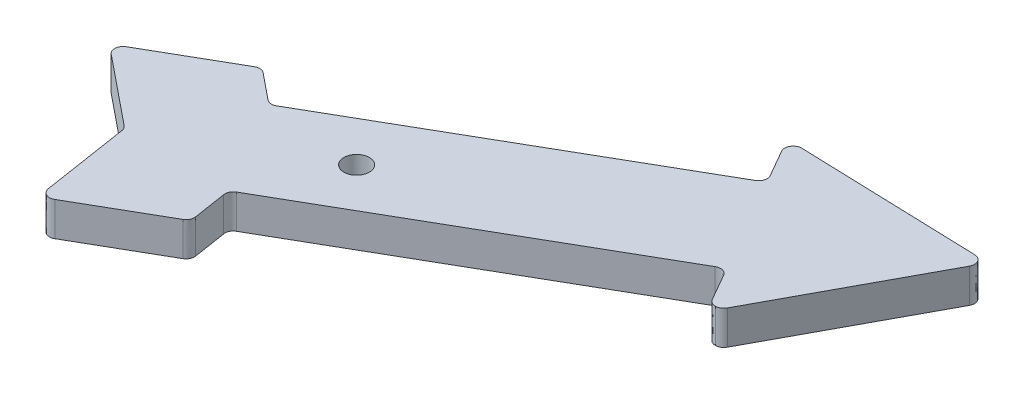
ISO-10303-21;
HEADER;
FILE_DESCRIPTION(('STEP AP214'),'2;1');
FILE_NAME('part.step','',(''),(''),'','','');
FILE_SCHEMA(('AUTOMOTIVE_DESIGN { 1 0 10303 214 1 1 1 1 }'));
ENDSEC;
DATA;
#1=APPLICATION_CONTEXT('core data for automotive mechanical design processes');
#2=APPLICATION_PROTOCOL_DEFINITION('international standard','automotive_design',2000,#1);
#3=PRODUCT_CONTEXT('',#1,'mechanical');
#4=PRODUCT('Part','Part','',(#3));
#5=PRODUCT_RELATED_PRODUCT_CATEGORY('part','',(#4));
#6=PRODUCT_DEFINITION_FORMATION('','',#4);
#7=PRODUCT_DEFINITION_CONTEXT('part definition',#1,'design');
#8=PRODUCT_DEFINITION('design','',#6,#7);
#9=PRODUCT_DEFINITION_SHAPE('','',#8);
#10=(LENGTH_UNIT() NAMED_UNIT(*) SI_UNIT(.MILLI.,.METRE.));
#11=(NAMED_UNIT(*) PLANE_ANGLE_UNIT() SI_UNIT($,.RADIAN.));
#12=(NAMED_UNIT(*) SI_UNIT($,.STERADIAN.) SOLID_ANGLE_UNIT());
#13=UNCERTAINTY_MEASURE_WITH_UNIT(LENGTH_MEASURE(1.E-05),#10,'distance_accuracy_value','');
#14=(GEOMETRIC_REPRESENTATION_CONTEXT(3) GLOBAL_UNCERTAINTY_ASSIGNED_CONTEXT((#13)) GLOBAL_UNIT_ASSIGNED_CONTEXT((#10,
#11,#12)) REPRESENTATION_CONTEXT('',''));
#15=CARTESIAN_POINT('',(0.,0.,0.));
#16=DIRECTION('',(0.,0.,1.));
#17=DIRECTION('',(1.,0.,0.));
#18=AXIS2_PLACEMENT_3D('',#15,#16,#17);
#19=CARTESIAN_POINT('',(-4.69190108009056,20.,10.2608139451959));
#20=DIRECTION('',(0.,1.,0.));
#21=DIRECTION('',(-0.86602540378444,0.,0.499999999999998));
#22=AXIS2_PLACEMENT_3D('',#19,#20,#21);
#23=PLANE('',#22);
#24=CARTESIAN_POINT('',(-4.7753296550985,20.,10.8484864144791));
#25=CARTESIAN_POINT('',(-4.84013398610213,20.,10.4316420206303));
#26=CARTESIAN_POINT('',(-4.65129163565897,20.,10.0383265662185));
#27=CARTESIAN_POINT('',(-4.2856021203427,20.,9.82811938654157));
#28=B_SPLINE_CURVE_WITH_KNOTS('',3,(#24,#25,#26,#27),.UNSPECIFIED.,.F.,.F.,(4,4),
(0.96551724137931,1.),.UNSPECIFIED.);
#29=CARTESIAN_POINT('',(-4.7753296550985,20.,10.8484864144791));
#30=VERTEX_POINT('',#29);
#31=CARTESIAN_POINT('',(-4.2856021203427,20.,9.82811938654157));
#32=VERTEX_POINT('',#31);
#33=EDGE_CURVE('E753',#30,#32,#28,.T.);
#34=ORIENTED_EDGE('',*,*,#33,.T.);
#35=DIRECTION('',(0.866935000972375,0.,-0.498421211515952));
#36=VECTOR('',#35,1.);
#37=CARTESIAN_POINT('',(-4.2856021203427,20.,9.82811938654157));
#38=LINE('',#37,#36);
#39=CARTESIAN_POINT('',(31.4467437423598,20.,-10.7152421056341));
#40=VERTEX_POINT('',#39);
#41=EDGE_CURVE('E163',#32,#40,#38,.T.);
#42=ORIENTED_EDGE('',*,*,#41,.T.);
#43=CARTESIAN_POINT('',(31.4467437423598,20.,-10.7152421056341));
#44=CARTESIAN_POINT('',(31.9241639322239,20.,-10.9897260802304));
#45=CARTESIAN_POINT('',(32.5376263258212,20.,-10.824178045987));
#46=CARTESIAN_POINT('',(32.8121103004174,20.,-10.3467578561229));
#47=B_SPLINE_CURVE_WITH_KNOTS('',3,(#43,#44,#45,#46),.UNSPECIFIED.,.F.,.F.,(4,4),
(0.0344827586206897,0.0689655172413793),.UNSPECIFIED.);
#48=CARTESIAN_POINT('',(32.8121103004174,20.,-10.3467578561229));
#49=VERTEX_POINT('',#48);
#50=EDGE_CURVE('E626',#40,#49,#47,.T.);
#51=ORIENTED_EDGE('',*,*,#50,.T.);
#52=DIRECTION('',(0.498400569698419,0.,0.866946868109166));
#53=VECTOR('',#52,1.);
#54=CARTESIAN_POINT('',(32.8121103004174,20.,-10.3467578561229));
#55=LINE('',#54,#53);
#56=CARTESIAN_POINT('',(34.6211579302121,20.,-7.19999544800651));
#57=VERTEX_POINT('',#56);
#58=EDGE_CURVE('E781',#49,#57,#55,.T.);
#59=ORIENTED_EDGE('',*,*,#58,.T.);
#60=CARTESIAN_POINT('',(34.6211579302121,20.,-7.19999544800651));
#61=CARTESIAN_POINT('',(34.8069383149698,20.,-6.87701438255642));
#62=CARTESIAN_POINT('',(35.1291082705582,20.,-6.69339965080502));
#63=CARTESIAN_POINT('',(35.5016397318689,20.,-6.69855623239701));
#64=B_SPLINE_CURVE_WITH_KNOTS('',3,(#60,#61,#62,#63),.UNSPECIFIED.,.F.,.F.,(4,4),
(0.103448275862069,0.137931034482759),.UNSPECIFIED.);
#65=CARTESIAN_POINT('',(35.5016397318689,20.,-6.69855623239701));
#66=VERTEX_POINT('',#65);
#67=EDGE_CURVE('E462',#57,#66,#64,.T.);
#68=ORIENTED_EDGE('',*,*,#67,.T.);
#69=CARTESIAN_POINT('',(35.5016397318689,20.,-6.69855623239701));
#70=CARTESIAN_POINT('',(35.8741345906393,20.,-6.70357621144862));
#71=CARTESIAN_POINT('',(36.1913068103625,20.,-6.89581781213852));
#72=CARTESIAN_POINT('',(36.3682234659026,20.,-7.22358917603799));
#73=B_SPLINE_CURVE_WITH_KNOTS('',3,(#69,#70,#71,#72),.UNSPECIFIED.,.F.,.F.,(4,4),
(0.137931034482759,0.172413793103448),.UNSPECIFIED.);
#74=CARTESIAN_POINT('',(36.3682234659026,20.,-7.22358917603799));
#75=VERTEX_POINT('',#74);
#76=EDGE_CURVE('E457',#66,#75,#73,.T.);
#77=ORIENTED_EDGE('',*,*,#76,.T.);
#78=DIRECTION('',(0.474814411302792,0.,-0.880085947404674));
#79=VECTOR('',#78,1.);
#80=CARTESIAN_POINT('',(36.3682234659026,20.,-7.22358917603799));
#81=LINE('',#80,#79);
#82=CARTESIAN_POINT('',(46.3412612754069,20.,-25.7089809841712));
#83=VERTEX_POINT('',#82);
#84=EDGE_CURVE('E461',#75,#83,#81,.T.);
#85=ORIENTED_EDGE('',*,*,#84,.T.);
#86=CARTESIAN_POINT('',(46.3412612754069,20.,-25.7089809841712));
#87=CARTESIAN_POINT('',(46.5105999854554,20.,-26.0226777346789));
#88=CARTESIAN_POINT('',(46.5056903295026,20.,-26.3731815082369));
#89=CARTESIAN_POINT('',(46.3280965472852,20.,-26.6821829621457));
#90=B_SPLINE_CURVE_WITH_KNOTS('',3,(#86,#87,#88,#89),.UNSPECIFIED.,.F.,.F.,(4,4),
(0.206896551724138,0.241379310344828),.UNSPECIFIED.);
#91=CARTESIAN_POINT('',(46.3280965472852,20.,-26.6821829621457));
#92=VERTEX_POINT('',#91);
#93=EDGE_CURVE('E427',#83,#92,#90,.T.);
#94=ORIENTED_EDGE('',*,*,#93,.T.);
#95=CARTESIAN_POINT('',(46.3280965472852,20.,-26.6821829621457));
#96=CARTESIAN_POINT('',(46.1505893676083,20.,-26.9912344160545));
#97=CARTESIAN_POINT('',(45.8498918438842,20.,-27.1716578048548));
#98=CARTESIAN_POINT('',(45.4936959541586,20.,-27.1832071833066));
#99=B_SPLINE_CURVE_WITH_KNOTS('',3,(#95,#96,#97,#98),.UNSPECIFIED.,.F.,.F.,(4,4),
(0.241379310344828,0.275862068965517),.UNSPECIFIED.);
#100=CARTESIAN_POINT('',(45.4936959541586,20.,-27.1832071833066));
#101=VERTEX_POINT('',#100);
#102=EDGE_CURVE('E422',#92,#101,#99,.T.);
#103=ORIENTED_EDGE('',*,*,#102,.T.);
#104=DIRECTION('',(-0.999472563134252,0.,-0.0324745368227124));
#105=VECTOR('',#104,1.);
#106=CARTESIAN_POINT('',(45.4936959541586,20.,-27.1832071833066));
#107=LINE('',#106,#105);
#108=CARTESIAN_POINT('',(24.5007223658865,20.,-27.8653040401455));
#109=VERTEX_POINT('',#108);
#110=EDGE_CURVE('E417',#101,#109,#107,.T.);
#111=ORIENTED_EDGE('',*,*,#110,.T.);
#112=CARTESIAN_POINT('',(24.5007223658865,20.,-27.8653040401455));
#113=CARTESIAN_POINT('',(24.1283619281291,20.,-27.8774512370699));
#114=CARTESIAN_POINT('',(23.8027263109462,20.,-27.7000686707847));
#115=CARTESIAN_POINT('',(23.6110618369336,20.,-27.3806412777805));
#116=B_SPLINE_CURVE_WITH_KNOTS('',3,(#112,#113,#114,#115),.UNSPECIFIED.,.F.,.F.,(4,4),
(0.310344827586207,0.344827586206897),.UNSPECIFIED.);
#117=CARTESIAN_POINT('',(23.6110618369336,20.,-27.3806412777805));
#118=VERTEX_POINT('',#117);
#119=EDGE_CURVE('E409',#109,#118,#116,.T.);
#120=ORIENTED_EDGE('',*,*,#119,.T.);
#121=CARTESIAN_POINT('',(23.6110618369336,20.,-27.3806412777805));
#122=CARTESIAN_POINT('',(23.4191241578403,20.,-27.061287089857));
#123=CARTESIAN_POINT('',(23.4156149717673,20.,-26.6905651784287));
#124=CARTESIAN_POINT('',(23.6013587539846,20.,-26.3674475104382));
#125=B_SPLINE_CURVE_WITH_KNOTS('',3,(#121,#122,#123,#124),.UNSPECIFIED.,.F.,.F.,(4,4),
(0.344827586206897,0.379310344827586),.UNSPECIFIED.);
#126=CARTESIAN_POINT('',(23.6013587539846,20.,-26.3674475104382));
#127=VERTEX_POINT('',#126);
#128=EDGE_CURVE('E405',#118,#127,#125,.T.);
#129=ORIENTED_EDGE('',*,*,#128,.T.);
#130=DIRECTION('',(0.498424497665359,0.,0.866933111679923));
#131=VECTOR('',#130,1.);
#132=CARTESIAN_POINT('',(23.6013587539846,20.,-26.3674475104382));
#133=LINE('',#132,#131);
#134=CARTESIAN_POINT('',(25.4105429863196,20.,-23.2206484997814));
#135=VERTEX_POINT('',#134);
#136=EDGE_CURVE('E385',#127,#135,#133,.T.);
#137=ORIENTED_EDGE('',*,*,#136,.T.);
#138=CARTESIAN_POINT('',(25.4105429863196,20.,-23.2206484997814));
#139=CARTESIAN_POINT('',(25.6850269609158,20.,-22.7432283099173));
#140=CARTESIAN_POINT('',(25.5194789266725,20.,-22.12976591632));
#141=CARTESIAN_POINT('',(25.0420587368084,20.,-21.8552819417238));
#142=B_SPLINE_CURVE_WITH_KNOTS('',3,(#138,#139,#140,#141),.UNSPECIFIED.,.F.,.F.,(4,4),
(0.413793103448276,0.448275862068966),.UNSPECIFIED.);
#143=CARTESIAN_POINT('',(25.0420587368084,20.,-21.8552819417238));
#144=VERTEX_POINT('',#143);
#145=EDGE_CURVE('E380',#135,#144,#142,.T.);
#146=ORIENTED_EDGE('',*,*,#145,.T.);
#147=DIRECTION('',(-0.866935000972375,0.,0.498421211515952));
#148=VECTOR('',#147,1.);
#149=CARTESIAN_POINT('',(25.0420587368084,20.,-21.8552819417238));
#150=LINE('',#149,#148);
#151=CARTESIAN_POINT('',(-10.6902871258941,20.,-1.31192044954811));
#152=VERTEX_POINT('',#151);
#153=EDGE_CURVE('E375',#144,#152,#150,.T.);
#154=ORIENTED_EDGE('',*,*,#153,.T.);
#155=CARTESIAN_POINT('',(-10.6902871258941,20.,-1.31192044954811));
#156=CARTESIAN_POINT('',(-11.0559766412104,20.,-1.10171326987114));
#157=CARTESIAN_POINT('',(-11.4908529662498,20.,-1.13654115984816));
#158=CARTESIAN_POINT('',(-11.8184861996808,20.,-1.40221856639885));
#159=B_SPLINE_CURVE_WITH_KNOTS('',3,(#155,#156,#157,#158),.UNSPECIFIED.,.F.,.F.,(4,4),
(0.482758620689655,0.517241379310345),.UNSPECIFIED.);
#160=CARTESIAN_POINT('',(-11.8184861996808,20.,-1.40221856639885));
#161=VERTEX_POINT('',#160);
#162=EDGE_CURVE('E370',#152,#161,#159,.T.);
#163=ORIENTED_EDGE('',*,*,#162,.T.);
#164=DIRECTION('',(-0.776723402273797,0.,-0.62984185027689));
#165=VECTOR('',#164,1.);
#166=CARTESIAN_POINT('',(-11.8184861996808,20.,-1.40221856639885));
#167=LINE('',#166,#165);
#168=CARTESIAN_POINT('',(-14.8846372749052,20.,-3.88854801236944));
#169=VERTEX_POINT('',#168);
#170=EDGE_CURVE('E349',#161,#169,#167,.T.);
#171=ORIENTED_EDGE('',*,*,#170,.T.);
#172=CARTESIAN_POINT('',(-14.8846372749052,20.,-3.88854801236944));
#173=CARTESIAN_POINT('',(-15.2122705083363,20.,-4.15422541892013));
#174=CARTESIAN_POINT('',(-15.6471468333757,20.,-4.18905330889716));
#175=CARTESIAN_POINT('',(-16.0129229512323,20.,-3.97879612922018));
#176=B_SPLINE_CURVE_WITH_KNOTS('',3,(#172,#173,#174,#175),.UNSPECIFIED.,.F.,.F.,(4,4),
(0.551724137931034,0.586206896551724),.UNSPECIFIED.);
#177=CARTESIAN_POINT('',(-16.0129229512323,20.,-3.97879612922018));
#178=VERTEX_POINT('',#177);
#179=EDGE_CURVE('E344',#169,#178,#176,.T.);
#180=ORIENTED_EDGE('',*,*,#179,.T.);
#181=DIRECTION('',(-0.866931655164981,0.,0.498427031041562));
#182=VECTOR('',#181,1.);
#183=CARTESIAN_POINT('',(-16.0129229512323,20.,-3.97879612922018));
#184=LINE('',#183,#182);
#185=CARTESIAN_POINT('',(-25.5640114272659,20.,1.5124333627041));
#186=VERTEX_POINT('',#185);
#187=EDGE_CURVE('E339',#178,#186,#184,.T.);
#188=ORIENTED_EDGE('',*,*,#187,.T.);
#189=CARTESIAN_POINT('',(-25.5640114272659,20.,1.5124333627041));
#190=CARTESIAN_POINT('',(-25.8585002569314,20.,1.68176374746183));
#191=CARTESIAN_POINT('',(-26.0351992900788,20.,1.96091204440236));
#192=CARTESIAN_POINT('',(-26.0624055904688,20.,2.29958934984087));
#193=B_SPLINE_CURVE_WITH_KNOTS('',3,(#189,#190,#191,#192),.UNSPECIFIED.,.F.,.F.,(4,4),
(0.620689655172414,0.655172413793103),.UNSPECIFIED.);
#194=CARTESIAN_POINT('',(-26.0624055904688,20.,2.29958934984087));
#195=VERTEX_POINT('',#194);
#196=EDGE_CURVE('E331',#186,#195,#193,.T.);
#197=ORIENTED_EDGE('',*,*,#196,.T.);
#198=CARTESIAN_POINT('',(-26.0624055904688,20.,2.29958934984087));
#199=CARTESIAN_POINT('',(-26.0893752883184,20.,2.63847646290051));
#200=CARTESIAN_POINT('',(-25.9593734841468,20.,2.94204619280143));
#201=CARTESIAN_POINT('',(-25.6953647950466,20.,3.15612265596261));
#202=B_SPLINE_CURVE_WITH_KNOTS('',3,(#198,#199,#200,#201),.UNSPECIFIED.,.F.,.F.,(4,4),
(0.655172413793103,0.689655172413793),.UNSPECIFIED.);
#203=CARTESIAN_POINT('',(-25.6953647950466,20.,3.15612265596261));
#204=VERTEX_POINT('',#203);
#205=EDGE_CURVE('E327',#195,#204,#202,.T.);
#206=ORIENTED_EDGE('',*,*,#205,.T.);
#207=DIRECTION('',(0.776712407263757,0.,0.629855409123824));
#208=VECTOR('',#207,1.);
#209=CARTESIAN_POINT('',(-25.6953647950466,20.,3.15612265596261));
#210=LINE('',#209,#208);
#211=CARTESIAN_POINT('',(-17.6460854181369,20.,9.68348350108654));
#212=VERTEX_POINT('',#211);
#213=EDGE_CURVE('E305',#204,#212,#210,.T.);
#214=ORIENTED_EDGE('',*,*,#213,.T.);
#215=CARTESIAN_POINT('',(-17.6460854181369,20.,9.68348350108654));
#216=CARTESIAN_POINT('',(-17.445887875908,20.,9.84583581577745));
#217=CARTESIAN_POINT('',(-17.3274708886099,20.,10.051940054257));
#218=CARTESIAN_POINT('',(-17.2878112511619,20.,10.3066325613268));
#219=B_SPLINE_CURVE_WITH_KNOTS('',3,(#215,#216,#217,#218),.UNSPECIFIED.,.F.,.F.,(4,4),
(0.724137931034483,0.758620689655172),.UNSPECIFIED.);
#220=CARTESIAN_POINT('',(-17.2878112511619,20.,10.3066325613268));
#221=VERTEX_POINT('',#220);
#222=EDGE_CURVE('E300',#212,#221,#219,.T.);
#223=ORIENTED_EDGE('',*,*,#222,.T.);
#224=DIRECTION('',(0.153524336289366,0.,0.988144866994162));
#225=VECTOR('',#224,1.);
#226=CARTESIAN_POINT('',(-17.2878112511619,20.,10.3066325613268));
#227=LINE('',#226,#225);
#228=CARTESIAN_POINT('',(-15.6967747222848,20.,20.54718866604));
#229=VERTEX_POINT('',#228);
#230=EDGE_CURVE('E295',#221,#229,#227,.T.);
#231=ORIENTED_EDGE('',*,*,#230,.T.);
#232=CARTESIAN_POINT('',(-15.6967747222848,20.,20.54718866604));
#233=CARTESIAN_POINT('',(-15.6445860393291,20.,20.8829821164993));
#234=CARTESIAN_POINT('',(-15.4477136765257,20.,21.148175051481));
#235=CARTESIAN_POINT('',(-15.1413600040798,20.,21.2951951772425));
#236=B_SPLINE_CURVE_WITH_KNOTS('',3,(#232,#233,#234,#235),.UNSPECIFIED.,.F.,.F.,(4,4),
(0.793103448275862,0.827586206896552),.UNSPECIFIED.);
#237=CARTESIAN_POINT('',(-15.1413600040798,20.,21.2951951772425));
#238=VERTEX_POINT('',#237);
#239=EDGE_CURVE('E287',#229,#238,#236,.T.);
#240=ORIENTED_EDGE('',*,*,#239,.T.);
#241=CARTESIAN_POINT('',(-15.1413600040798,20.,21.2951951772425));
#242=CARTESIAN_POINT('',(-14.8349197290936,20.,21.442165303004));
#243=CARTESIAN_POINT('',(-14.5048769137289,20.,21.4300162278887));
#244=CARTESIAN_POINT('',(-14.2102148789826,20.,21.260585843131));
#245=B_SPLINE_CURVE_WITH_KNOTS('',3,(#241,#242,#243,#244),.UNSPECIFIED.,.F.,.F.,(4,4),
(0.827586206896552,0.862068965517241),.UNSPECIFIED.);
#246=CARTESIAN_POINT('',(-14.2102148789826,20.,21.260585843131));
#247=VERTEX_POINT('',#246);
#248=EDGE_CURVE('E245',#238,#247,#245,.T.);
#249=ORIENTED_EDGE('',*,*,#248,.T.);
#250=DIRECTION('',(0.866931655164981,0.,-0.498427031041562));
#251=VECTOR('',#250,1.);
#252=CARTESIAN_POINT('',(-14.2102148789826,20.,21.260585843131));
#253=LINE('',#252,#251);
#254=CARTESIAN_POINT('',(-4.65912640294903,20.,15.7693563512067));
#255=VERTEX_POINT('',#254);
#256=EDGE_CURVE('E239',#247,#255,#253,.T.);
#257=ORIENTED_EDGE('',*,*,#256,.T.);
#258=CARTESIAN_POINT('',(-4.65912640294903,20.,15.7693563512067));
#259=CARTESIAN_POINT('',(-4.29343688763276,20.,15.5591491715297));
#260=CARTESIAN_POINT('',(-4.1045945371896,20.,15.165833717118));
#261=CARTESIAN_POINT('',(-4.16934886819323,20.,14.7490759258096));
#262=B_SPLINE_CURVE_WITH_KNOTS('',3,(#258,#259,#260,#261),.UNSPECIFIED.,.F.,.F.,(4,4),
(0.896551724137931,0.931034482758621),.UNSPECIFIED.);
#263=CARTESIAN_POINT('',(-4.16934886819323,20.,14.7490759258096));
#264=VERTEX_POINT('',#263);
#265=EDGE_CURVE('E243',#255,#264,#262,.T.);
#266=ORIENTED_EDGE('',*,*,#265,.T.);
#267=DIRECTION('',(-0.153514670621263,0.,-0.988146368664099));
#268=VECTOR('',#267,1.);
#269=CARTESIAN_POINT('',(-4.16934886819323,20.,14.7490759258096));
#270=LINE('',#269,#268);
#271=EDGE_CURVE('E57',#264,#30,#270,.T.);
#272=ORIENTED_EDGE('',*,*,#271,.T.);
#273=EDGE_LOOP('',(#34,#42,#51,#59,#68,#77,#85,#94,#103,#111,#120,#129,#137,#146,#154,#163,#171,
#180,#188,#197,#206,#214,#223,#231,#240,#249,#257,#266,#272));
#274=FACE_BOUND('',#273,.T.);
#275=CARTESIAN_POINT('',(0.,20.,0.));
#276=DIRECTION('',(0.,1.,0.));
#277=DIRECTION('',(-0.86602540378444,0.,0.499999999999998));
#278=AXIS2_PLACEMENT_3D('',#275,#276,#277);
#279=CIRCLE('',#278,1.5);
#280=CARTESIAN_POINT('',(-1.29903810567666,20.,0.749999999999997));
#281=VERTEX_POINT('',#280);
#282=EDGE_CURVE('E757',#281,#281,#279,.T.);
#283=ORIENTED_EDGE('',*,*,#282,.F.);
#284=EDGE_LOOP('',(#283));
#285=FACE_BOUND('',#284,.T.);
#286=ADVANCED_FACE('F39',(#274,#285),#23,.T.);
#287=CARTESIAN_POINT('',(-4.69190108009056,16.,10.2608139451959));
#288=DIRECTION('',(0.,1.,0.));
#289=DIRECTION('',(-0.86602540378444,0.,0.499999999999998));
#290=AXIS2_PLACEMENT_3D('',#287,#288,#289);
#291=PLANE('',#290);
#292=CARTESIAN_POINT('',(-4.7753296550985,16.,10.8484864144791));
#293=CARTESIAN_POINT('',(-4.84013398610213,16.,10.4316420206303));
#294=CARTESIAN_POINT('',(-4.65129163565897,16.,10.0383265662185));
#295=CARTESIAN_POINT('',(-4.2856021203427,16.,9.82811938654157));
#296=B_SPLINE_CURVE_WITH_KNOTS('',3,(#292,#293,#294,#295),.UNSPECIFIED.,.F.,.F.,(4,4),
(0.96551724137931,1.),.UNSPECIFIED.);
#297=CARTESIAN_POINT('',(-4.7753296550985,16.,10.8484864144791));
#298=VERTEX_POINT('',#297);
#299=CARTESIAN_POINT('',(-4.2856021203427,16.,9.82811938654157));
#300=VERTEX_POINT('',#299);
#301=EDGE_CURVE('E638',#298,#300,#296,.T.);
#302=ORIENTED_EDGE('',*,*,#301,.F.);
#303=DIRECTION('',(-0.153514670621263,0.,-0.988146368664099));
#304=VECTOR('',#303,1.);
#305=CARTESIAN_POINT('',(-4.16934886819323,16.,14.7490759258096));
#306=LINE('',#305,#304);
#307=CARTESIAN_POINT('',(-4.16934886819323,16.,14.7490759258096));
#308=VERTEX_POINT('',#307);
#309=EDGE_CURVE('E155',#308,#298,#306,.T.);
#310=ORIENTED_EDGE('',*,*,#309,.F.);
#311=CARTESIAN_POINT('',(-4.65912640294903,16.,15.7693563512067));
#312=CARTESIAN_POINT('',(-4.29343688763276,16.,15.5591491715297));
#313=CARTESIAN_POINT('',(-4.1045945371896,16.,15.165833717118));
#314=CARTESIAN_POINT('',(-4.16934886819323,16.,14.7490759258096));
#315=B_SPLINE_CURVE_WITH_KNOTS('',3,(#311,#312,#313,#314),.UNSPECIFIED.,.F.,.F.,(4,4),
(0.896551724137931,0.931034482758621),.UNSPECIFIED.);
#316=CARTESIAN_POINT('',(-4.65912640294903,16.,15.7693563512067));
#317=VERTEX_POINT('',#316);
#318=EDGE_CURVE('E149',#317,#308,#315,.T.);
#319=ORIENTED_EDGE('',*,*,#318,.F.);
#320=DIRECTION('',(0.866931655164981,0.,-0.498427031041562));
#321=VECTOR('',#320,1.);
#322=CARTESIAN_POINT('',(-14.2102148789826,16.,21.260585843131));
#323=LINE('',#322,#321);
#324=CARTESIAN_POINT('',(-14.2102148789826,16.,21.260585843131));
#325=VERTEX_POINT('',#324);
#326=EDGE_CURVE('E253',#325,#317,#323,.T.);
#327=ORIENTED_EDGE('',*,*,#326,.F.);
#328=CARTESIAN_POINT('',(-15.1413600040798,16.,21.2951951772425));
#329=CARTESIAN_POINT('',(-14.8349197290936,16.,21.442165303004));
#330=CARTESIAN_POINT('',(-14.5048769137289,16.,21.4300162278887));
#331=CARTESIAN_POINT('',(-14.2102148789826,16.,21.260585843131));
#332=B_SPLINE_CURVE_WITH_KNOTS('',3,(#328,#329,#330,#331),.UNSPECIFIED.,.F.,.F.,(4,4),
(0.827586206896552,0.862068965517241),.UNSPECIFIED.);
#333=CARTESIAN_POINT('',(-15.1413600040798,16.,21.2951951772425));
#334=VERTEX_POINT('',#333);
#335=EDGE_CURVE('E598',#334,#325,#332,.T.);
#336=ORIENTED_EDGE('',*,*,#335,.F.);
#337=CARTESIAN_POINT('',(-15.6967747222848,16.,20.54718866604));
#338=CARTESIAN_POINT('',(-15.6445860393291,16.,20.8829821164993));
#339=CARTESIAN_POINT('',(-15.4477136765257,16.,21.148175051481));
#340=CARTESIAN_POINT('',(-15.1413600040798,16.,21.2951951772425));
#341=B_SPLINE_CURVE_WITH_KNOTS('',3,(#337,#338,#339,#340),.UNSPECIFIED.,.F.,.F.,(4,4),
(0.793103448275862,0.827586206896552),.UNSPECIFIED.);
#342=CARTESIAN_POINT('',(-15.6967747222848,16.,20.54718866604));
#343=VERTEX_POINT('',#342);
#344=EDGE_CURVE('E595',#343,#334,#341,.T.);
#345=ORIENTED_EDGE('',*,*,#344,.F.);
#346=DIRECTION('',(0.153524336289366,0.,0.988144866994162));
#347=VECTOR('',#346,1.);
#348=CARTESIAN_POINT('',(-17.2878112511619,16.,10.3066325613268));
#349=LINE('',#348,#347);
#350=CARTESIAN_POINT('',(-17.2878112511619,16.,10.3066325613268));
#351=VERTEX_POINT('',#350);
#352=EDGE_CURVE('E588',#351,#343,#349,.T.);
#353=ORIENTED_EDGE('',*,*,#352,.F.);
#354=CARTESIAN_POINT('',(-17.6460854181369,16.,9.68348350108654));
#355=CARTESIAN_POINT('',(-17.445887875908,16.,9.84583581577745));
#356=CARTESIAN_POINT('',(-17.3274708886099,16.,10.051940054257));
#357=CARTESIAN_POINT('',(-17.2878112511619,16.,10.3066325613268));
#358=B_SPLINE_CURVE_WITH_KNOTS('',3,(#354,#355,#356,#357),.UNSPECIFIED.,.F.,.F.,(4,4),
(0.724137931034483,0.758620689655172),.UNSPECIFIED.);
#359=CARTESIAN_POINT('',(-17.6460854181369,16.,9.68348350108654));
#360=VERTEX_POINT('',#359);
#361=EDGE_CURVE('E581',#360,#351,#358,.T.);
#362=ORIENTED_EDGE('',*,*,#361,.F.);
#363=DIRECTION('',(0.776712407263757,0.,0.629855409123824));
#364=VECTOR('',#363,1.);
#365=CARTESIAN_POINT('',(-25.6953647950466,16.,3.15612265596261));
#366=LINE('',#365,#364);
#367=CARTESIAN_POINT('',(-25.6953647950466,16.,3.15612265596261));
#368=VERTEX_POINT('',#367);
#369=EDGE_CURVE('E721',#368,#360,#366,.T.);
#370=ORIENTED_EDGE('',*,*,#369,.F.);
#371=CARTESIAN_POINT('',(-26.0624055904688,16.,2.29958934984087));
#372=CARTESIAN_POINT('',(-26.0893752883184,16.,2.63847646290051));
#373=CARTESIAN_POINT('',(-25.9593734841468,16.,2.94204619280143));
#374=CARTESIAN_POINT('',(-25.6953647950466,16.,3.15612265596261));
#375=B_SPLINE_CURVE_WITH_KNOTS('',3,(#371,#372,#373,#374),.UNSPECIFIED.,.F.,.F.,(4,4),
(0.655172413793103,0.689655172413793),.UNSPECIFIED.);
#376=CARTESIAN_POINT('',(-26.0624055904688,16.,2.29958934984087));
#377=VERTEX_POINT('',#376);
#378=EDGE_CURVE('E568',#377,#368,#375,.T.);
#379=ORIENTED_EDGE('',*,*,#378,.F.);
#380=CARTESIAN_POINT('',(-25.5640114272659,16.,1.5124333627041));
#381=CARTESIAN_POINT('',(-25.8585002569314,16.,1.68176374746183));
#382=CARTESIAN_POINT('',(-26.0351992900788,16.,1.96091204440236));
#383=CARTESIAN_POINT('',(-26.0624055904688,16.,2.29958934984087));
#384=B_SPLINE_CURVE_WITH_KNOTS('',3,(#380,#381,#382,#383),.UNSPECIFIED.,.F.,.F.,(4,4),
(0.620689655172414,0.655172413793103),.UNSPECIFIED.);
#385=CARTESIAN_POINT('',(-25.5640114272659,16.,1.5124333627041));
#386=VERTEX_POINT('',#385);
#387=EDGE_CURVE('E562',#386,#377,#384,.T.);
#388=ORIENTED_EDGE('',*,*,#387,.F.);
#389=DIRECTION('',(-0.866931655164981,0.,0.498427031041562));
#390=VECTOR('',#389,1.);
#391=CARTESIAN_POINT('',(-16.0129229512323,16.,-3.97879612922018));
#392=LINE('',#391,#390);
#393=CARTESIAN_POINT('',(-16.0129229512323,16.,-3.97879612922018));
#394=VERTEX_POINT('',#393);
#395=EDGE_CURVE('E707',#394,#386,#392,.T.);
#396=ORIENTED_EDGE('',*,*,#395,.F.);
#397=CARTESIAN_POINT('',(-14.8846372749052,16.,-3.88854801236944));
#398=CARTESIAN_POINT('',(-15.2122705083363,16.,-4.15422541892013));
#399=CARTESIAN_POINT('',(-15.6471468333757,16.,-4.18905330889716));
#400=CARTESIAN_POINT('',(-16.0129229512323,16.,-3.97879612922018));
#401=B_SPLINE_CURVE_WITH_KNOTS('',3,(#397,#398,#399,#400),.UNSPECIFIED.,.F.,.F.,(4,4),
(0.551724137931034,0.586206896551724),.UNSPECIFIED.);
#402=CARTESIAN_POINT('',(-14.8846372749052,16.,-3.88854801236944));
#403=VERTEX_POINT('',#402);
#404=EDGE_CURVE('E547',#403,#394,#401,.T.);
#405=ORIENTED_EDGE('',*,*,#404,.F.);
#406=DIRECTION('',(-0.776723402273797,0.,-0.62984185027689));
#407=VECTOR('',#406,1.);
#408=CARTESIAN_POINT('',(-11.8184861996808,16.,-1.40221856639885));
#409=LINE('',#408,#407);
#410=CARTESIAN_POINT('',(-11.8184861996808,16.,-1.40221856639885));
#411=VERTEX_POINT('',#410);
#412=EDGE_CURVE('E541',#411,#403,#409,.T.);
#413=ORIENTED_EDGE('',*,*,#412,.F.);
#414=CARTESIAN_POINT('',(-10.6902871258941,16.,-1.31192044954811));
#415=CARTESIAN_POINT('',(-11.0559766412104,16.,-1.10171326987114));
#416=CARTESIAN_POINT('',(-11.4908529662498,16.,-1.13654115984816));
#417=CARTESIAN_POINT('',(-11.8184861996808,16.,-1.40221856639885));
#418=B_SPLINE_CURVE_WITH_KNOTS('',3,(#414,#415,#416,#417),.UNSPECIFIED.,.F.,.F.,(4,4),
(0.482758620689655,0.517241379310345),.UNSPECIFIED.);
#419=CARTESIAN_POINT('',(-10.6902871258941,16.,-1.31192044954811));
#420=VERTEX_POINT('',#419);
#421=EDGE_CURVE('E696',#420,#411,#418,.T.);
#422=ORIENTED_EDGE('',*,*,#421,.F.);
#423=DIRECTION('',(-0.866935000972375,0.,0.498421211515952));
#424=VECTOR('',#423,1.);
#425=CARTESIAN_POINT('',(25.0420587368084,16.,-21.8552819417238));
#426=LINE('',#425,#424);
#427=CARTESIAN_POINT('',(25.0420587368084,16.,-21.8552819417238));
#428=VERTEX_POINT('',#427);
#429=EDGE_CURVE('E528',#428,#420,#426,.T.);
#430=ORIENTED_EDGE('',*,*,#429,.F.);
#431=CARTESIAN_POINT('',(25.4105429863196,16.,-23.2206484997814));
#432=CARTESIAN_POINT('',(25.6850269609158,16.,-22.7432283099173));
#433=CARTESIAN_POINT('',(25.5194789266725,16.,-22.12976591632));
#434=CARTESIAN_POINT('',(25.0420587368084,16.,-21.8552819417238));
#435=B_SPLINE_CURVE_WITH_KNOTS('',3,(#431,#432,#433,#434),.UNSPECIFIED.,.F.,.F.,(4,4),
(0.413793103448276,0.448275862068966),.UNSPECIFIED.);
#436=CARTESIAN_POINT('',(25.4105429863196,16.,-23.2206484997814));
#437=VERTEX_POINT('',#436);
#438=EDGE_CURVE('E521',#437,#428,#435,.T.);
#439=ORIENTED_EDGE('',*,*,#438,.F.);
#440=DIRECTION('',(0.498424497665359,0.,0.866933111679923));
#441=VECTOR('',#440,1.);
#442=CARTESIAN_POINT('',(23.6013587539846,16.,-26.3674475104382));
#443=LINE('',#442,#441);
#444=CARTESIAN_POINT('',(23.6013587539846,16.,-26.3674475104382));
#445=VERTEX_POINT('',#444);
#446=EDGE_CURVE('E684',#445,#437,#443,.T.);
#447=ORIENTED_EDGE('',*,*,#446,.F.);
#448=CARTESIAN_POINT('',(23.6110618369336,16.,-27.3806412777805));
#449=CARTESIAN_POINT('',(23.4191241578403,16.,-27.061287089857));
#450=CARTESIAN_POINT('',(23.4156149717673,16.,-26.6905651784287));
#451=CARTESIAN_POINT('',(23.6013587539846,16.,-26.3674475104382));
#452=B_SPLINE_CURVE_WITH_KNOTS('',3,(#448,#449,#450,#451),.UNSPECIFIED.,.F.,.F.,(4,4),
(0.344827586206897,0.379310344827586),.UNSPECIFIED.);
#453=CARTESIAN_POINT('',(23.6110618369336,16.,-27.3806412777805));
#454=VERTEX_POINT('',#453);
#455=EDGE_CURVE('E508',#454,#445,#452,.T.);
#456=ORIENTED_EDGE('',*,*,#455,.F.);
#457=CARTESIAN_POINT('',(24.5007223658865,16.,-27.8653040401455));
#458=CARTESIAN_POINT('',(24.1283619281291,16.,-27.8774512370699));
#459=CARTESIAN_POINT('',(23.8027263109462,16.,-27.7000686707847));
#460=CARTESIAN_POINT('',(23.6110618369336,16.,-27.3806412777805));
#461=B_SPLINE_CURVE_WITH_KNOTS('',3,(#457,#458,#459,#460),.UNSPECIFIED.,.F.,.F.,(4,4),
(0.310344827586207,0.344827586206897),.UNSPECIFIED.);
#462=CARTESIAN_POINT('',(24.5007223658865,16.,-27.8653040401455));
#463=VERTEX_POINT('',#462);
#464=EDGE_CURVE('E502',#463,#454,#461,.T.);
#465=ORIENTED_EDGE('',*,*,#464,.F.);
#466=DIRECTION('',(-0.999472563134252,0.,-0.0324745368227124));
#467=VECTOR('',#466,1.);
#468=CARTESIAN_POINT('',(45.4936959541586,16.,-27.1832071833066));
#469=LINE('',#468,#467);
#470=CARTESIAN_POINT('',(45.4936959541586,16.,-27.1832071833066));
#471=VERTEX_POINT('',#470);
#472=EDGE_CURVE('E670',#471,#463,#469,.T.);
#473=ORIENTED_EDGE('',*,*,#472,.F.);
#474=CARTESIAN_POINT('',(46.3280965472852,16.,-26.6821829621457));
#475=CARTESIAN_POINT('',(46.1505893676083,16.,-26.9912344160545));
#476=CARTESIAN_POINT('',(45.8498918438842,16.,-27.1716578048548));
#477=CARTESIAN_POINT('',(45.4936959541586,16.,-27.1832071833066));
#478=B_SPLINE_CURVE_WITH_KNOTS('',3,(#474,#475,#476,#477),.UNSPECIFIED.,.F.,.F.,(4,4),
(0.241379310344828,0.275862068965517),.UNSPECIFIED.);
#479=CARTESIAN_POINT('',(46.3280965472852,16.,-26.6821829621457));
#480=VERTEX_POINT('',#479);
#481=EDGE_CURVE('E487',#480,#471,#478,.T.);
#482=ORIENTED_EDGE('',*,*,#481,.F.);
#483=CARTESIAN_POINT('',(46.3412612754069,16.,-25.7089809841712));
#484=CARTESIAN_POINT('',(46.5105999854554,16.,-26.0226777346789));
#485=CARTESIAN_POINT('',(46.5056903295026,16.,-26.3731815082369));
#486=CARTESIAN_POINT('',(46.3280965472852,16.,-26.6821829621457));
#487=B_SPLINE_CURVE_WITH_KNOTS('',3,(#483,#484,#485,#486),.UNSPECIFIED.,.F.,.F.,(4,4),
(0.206896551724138,0.241379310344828),.UNSPECIFIED.);
#488=CARTESIAN_POINT('',(46.3412612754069,16.,-25.7089809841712));
#489=VERTEX_POINT('',#488);
#490=EDGE_CURVE('E480',#489,#480,#487,.T.);
#491=ORIENTED_EDGE('',*,*,#490,.F.);
#492=DIRECTION('',(0.474814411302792,0.,-0.880085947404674));
#493=VECTOR('',#492,1.);
#494=CARTESIAN_POINT('',(36.3682234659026,16.,-7.22358917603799));
#495=LINE('',#494,#493);
#496=CARTESIAN_POINT('',(36.3682234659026,16.,-7.22358917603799));
#497=VERTEX_POINT('',#496);
#498=EDGE_CURVE('E656',#497,#489,#495,.T.);
#499=ORIENTED_EDGE('',*,*,#498,.F.);
#500=CARTESIAN_POINT('',(35.5016397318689,16.,-6.69855623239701));
#501=CARTESIAN_POINT('',(35.8741345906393,16.,-6.70357621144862));
#502=CARTESIAN_POINT('',(36.1913068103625,16.,-6.89581781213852));
#503=CARTESIAN_POINT('',(36.3682234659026,16.,-7.22358917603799));
#504=B_SPLINE_CURVE_WITH_KNOTS('',3,(#500,#501,#502,#503),.UNSPECIFIED.,.F.,.F.,(4,4),
(0.137931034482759,0.172413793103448),.UNSPECIFIED.);
#505=CARTESIAN_POINT('',(35.5016397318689,16.,-6.69855623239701));
#506=VERTEX_POINT('',#505);
#507=EDGE_CURVE('E649',#506,#497,#504,.T.);
#508=ORIENTED_EDGE('',*,*,#507,.F.);
#509=CARTESIAN_POINT('',(34.6211579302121,16.,-7.19999544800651));
#510=CARTESIAN_POINT('',(34.8069383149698,16.,-6.87701438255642));
#511=CARTESIAN_POINT('',(35.1291082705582,16.,-6.69339965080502));
#512=CARTESIAN_POINT('',(35.5016397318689,16.,-6.69855623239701));
#513=B_SPLINE_CURVE_WITH_KNOTS('',3,(#509,#510,#511,#512),.UNSPECIFIED.,.F.,.F.,(4,4),
(0.103448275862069,0.137931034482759),.UNSPECIFIED.);
#514=CARTESIAN_POINT('',(34.6211579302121,16.,-7.19999544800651));
#515=VERTEX_POINT('',#514);
#516=EDGE_CURVE('E636',#515,#506,#513,.T.);
#517=ORIENTED_EDGE('',*,*,#516,.F.);
#518=DIRECTION('',(0.498400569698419,0.,0.866946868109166));
#519=VECTOR('',#518,1.);
#520=CARTESIAN_POINT('',(32.8121103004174,16.,-10.3467578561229));
#521=LINE('',#520,#519);
#522=CARTESIAN_POINT('',(32.8121103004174,16.,-10.3467578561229));
#523=VERTEX_POINT('',#522);
#524=EDGE_CURVE('E634',#523,#515,#521,.T.);
#525=ORIENTED_EDGE('',*,*,#524,.F.);
#526=CARTESIAN_POINT('',(31.4467437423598,16.,-10.7152421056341));
#527=CARTESIAN_POINT('',(31.9241639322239,16.,-10.9897260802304));
#528=CARTESIAN_POINT('',(32.5376263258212,16.,-10.824178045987));
#529=CARTESIAN_POINT('',(32.8121103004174,16.,-10.3467578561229));
#530=B_SPLINE_CURVE_WITH_KNOTS('',3,(#526,#527,#528,#529),.UNSPECIFIED.,.F.,.F.,(4,4),
(0.0344827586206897,0.0689655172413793),.UNSPECIFIED.);
#531=CARTESIAN_POINT('',(31.4467437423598,16.,-10.7152421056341));
#532=VERTEX_POINT('',#531);
#533=EDGE_CURVE('E625',#532,#523,#530,.T.);
#534=ORIENTED_EDGE('',*,*,#533,.F.);
#535=DIRECTION('',(0.866935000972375,0.,-0.498421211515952));
#536=VECTOR('',#535,1.);
#537=CARTESIAN_POINT('',(-4.2856021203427,16.,9.82811938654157));
#538=LINE('',#537,#536);
#539=EDGE_CURVE('E632',#300,#532,#538,.T.);
#540=ORIENTED_EDGE('',*,*,#539,.F.);
#541=EDGE_LOOP('',(#302,#310,#319,#327,#336,#345,#353,#362,#370,#379,#388,#396,#405,#413,#422,
#430,#439,#447,#456,#465,#473,#482,#491,#499,#508,#517,#525,#534,#540));
#542=FACE_BOUND('',#541,.T.);
#543=CARTESIAN_POINT('',(0.,16.,0.));
#544=DIRECTION('',(0.,1.,0.));
#545=DIRECTION('',(-0.86602540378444,0.,0.499999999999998));
#546=AXIS2_PLACEMENT_3D('',#543,#544,#545);
#547=CIRCLE('',#546,1.5);
#548=CARTESIAN_POINT('',(-1.29903810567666,16.,0.749999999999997));
#549=VERTEX_POINT('',#548);
#550=EDGE_CURVE('E759',#549,#549,#547,.T.);
#551=ORIENTED_EDGE('',*,*,#550,.T.);
#552=EDGE_LOOP('',(#551));
#553=FACE_BOUND('',#552,.T.);
#554=ADVANCED_FACE('F630',(#542,#553),#291,.F.);
#555=DIRECTION('',(0.,-1.,0.));
#556=VECTOR('',#555,1.);
#557=SURFACE_OF_LINEAR_EXTRUSION('',#28,#556);
#558=ORIENTED_EDGE('',*,*,#301,.T.);
#559=DIRECTION('',(0.,-1.,0.));
#560=VECTOR('',#559,1.);
#561=CARTESIAN_POINT('',(-4.2856021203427,20.,9.82811938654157));
#562=LINE('',#561,#560);
#563=EDGE_CURVE('E11',#32,#300,#562,.T.);
#564=ORIENTED_EDGE('',*,*,#563,.F.);
#565=ORIENTED_EDGE('',*,*,#33,.F.);
#566=DIRECTION('',(0.,-1.,0.));
#567=VECTOR('',#566,1.);
#568=CARTESIAN_POINT('',(-4.7753296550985,20.,10.8484864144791));
#569=LINE('',#568,#567);
#570=EDGE_CURVE('E259',#30,#298,#569,.T.);
#571=ORIENTED_EDGE('',*,*,#570,.T.);
#572=EDGE_LOOP('',(#558,#564,#565,#571));
#573=FACE_BOUND('',#572,.T.);
#574=ADVANCED_FACE('F41',(#573),#557,.F.);
#575=CARTESIAN_POINT('',(-4.2856021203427,20.,9.82811938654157));
#576=DIRECTION('',(-0.498421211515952,0.,-0.866935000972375));
#577=DIRECTION('',(-0.866935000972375,0.,0.498421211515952));
#578=AXIS2_PLACEMENT_3D('',#575,#576,#577);
#579=PLANE('',#578);
#580=ORIENTED_EDGE('',*,*,#539,.T.);
#581=DIRECTION('',(0.,-1.,0.));
#582=VECTOR('',#581,1.);
#583=CARTESIAN_POINT('',(31.4467437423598,20.,-10.7152421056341));
#584=LINE('',#583,#582);
#585=EDGE_CURVE('E49',#40,#532,#584,.T.);
#586=ORIENTED_EDGE('',*,*,#585,.F.);
#587=ORIENTED_EDGE('',*,*,#41,.F.);
#588=ORIENTED_EDGE('',*,*,#563,.T.);
#589=EDGE_LOOP('',(#580,#586,#587,#588));
#590=FACE_BOUND('',#589,.T.);
#591=ADVANCED_FACE('F788',(#590),#579,.F.);
#592=DIRECTION('',(0.,-1.,0.));
#593=VECTOR('',#592,1.);
#594=SURFACE_OF_LINEAR_EXTRUSION('',#47,#593);
#595=ORIENTED_EDGE('',*,*,#533,.T.);
#596=DIRECTION('',(0.,-1.,0.));
#597=VECTOR('',#596,1.);
#598=CARTESIAN_POINT('',(32.8121103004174,20.,-10.3467578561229));
#599=LINE('',#598,#597);
#600=EDGE_CURVE('E617',#49,#523,#599,.T.);
#601=ORIENTED_EDGE('',*,*,#600,.F.);
#602=ORIENTED_EDGE('',*,*,#50,.F.);
#603=ORIENTED_EDGE('',*,*,#585,.T.);
#604=EDGE_LOOP('',(#595,#601,#602,#603));
#605=FACE_BOUND('',#604,.T.);
#606=ADVANCED_FACE('F623',(#605),#594,.F.);
#607=CARTESIAN_POINT('',(32.8121103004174,20.,-10.3467578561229));
#608=DIRECTION('',(0.866946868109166,0.,-0.498400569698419));
#609=DIRECTION('',(-0.498400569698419,0.,-0.866946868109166));
#610=AXIS2_PLACEMENT_3D('',#607,#608,#609);
#611=PLANE('',#610);
#612=ORIENTED_EDGE('',*,*,#524,.T.);
#613=DIRECTION('',(0.,-1.,0.));
#614=VECTOR('',#613,1.);
#615=CARTESIAN_POINT('',(34.6211579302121,20.,-7.19999544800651));
#616=LINE('',#615,#614);
#617=EDGE_CURVE('E614',#57,#515,#616,.T.);
#618=ORIENTED_EDGE('',*,*,#617,.F.);
#619=ORIENTED_EDGE('',*,*,#58,.F.);
#620=ORIENTED_EDGE('',*,*,#600,.T.);
#621=EDGE_LOOP('',(#612,#618,#619,#620));
#622=FACE_BOUND('',#621,.T.);
#623=ADVANCED_FACE('F787',(#622),#611,.F.);
#624=DIRECTION('',(0.,-1.,0.));
#625=VECTOR('',#624,1.);
#626=SURFACE_OF_LINEAR_EXTRUSION('',#64,#625);
#627=ORIENTED_EDGE('',*,*,#516,.T.);
#628=DIRECTION('',(0.,-1.,0.));
#629=VECTOR('',#628,1.);
#630=CARTESIAN_POINT('',(35.5016397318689,20.,-6.69855623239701));
#631=LINE('',#630,#629);
#632=EDGE_CURVE('E611',#66,#506,#631,.T.);
#633=ORIENTED_EDGE('',*,*,#632,.F.);
#634=ORIENTED_EDGE('',*,*,#67,.F.);
#635=ORIENTED_EDGE('',*,*,#617,.T.);
#636=EDGE_LOOP('',(#627,#633,#634,#635));
#637=FACE_BOUND('',#636,.T.);
#638=ADVANCED_FACE('F453',(#637),#626,.F.);
#639=DIRECTION('',(0.,-1.,0.));
#640=VECTOR('',#639,1.);
#641=SURFACE_OF_LINEAR_EXTRUSION('',#73,#640);
#642=ORIENTED_EDGE('',*,*,#507,.T.);
#643=DIRECTION('',(0.,-1.,0.));
#644=VECTOR('',#643,1.);
#645=CARTESIAN_POINT('',(36.3682234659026,20.,-7.22358917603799));
#646=LINE('',#645,#644);
#647=EDGE_CURVE('E608',#75,#497,#646,.T.);
#648=ORIENTED_EDGE('',*,*,#647,.F.);
#649=ORIENTED_EDGE('',*,*,#76,.F.);
#650=ORIENTED_EDGE('',*,*,#632,.T.);
#651=EDGE_LOOP('',(#642,#648,#649,#650));
#652=FACE_BOUND('',#651,.T.);
#653=ADVANCED_FACE('F448',(#652),#641,.F.);
#654=CARTESIAN_POINT('',(36.3682234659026,20.,-7.22358917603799));
#655=DIRECTION('',(-0.880085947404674,0.,-0.474814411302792));
#656=DIRECTION('',(-0.474814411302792,0.,0.880085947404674));
#657=AXIS2_PLACEMENT_3D('',#654,#655,#656);
#658=PLANE('',#657);
#659=ORIENTED_EDGE('',*,*,#498,.T.);
#660=DIRECTION('',(0.,-1.,0.));
#661=VECTOR('',#660,1.);
#662=CARTESIAN_POINT('',(46.3412612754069,20.,-25.7089809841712));
#663=LINE('',#662,#661);
#664=EDGE_CURVE('E482',#83,#489,#663,.T.);
#665=ORIENTED_EDGE('',*,*,#664,.F.);
#666=ORIENTED_EDGE('',*,*,#84,.F.);
#667=ORIENTED_EDGE('',*,*,#647,.T.);
#668=EDGE_LOOP('',(#659,#665,#666,#667));
#669=FACE_BOUND('',#668,.T.);
#670=ADVANCED_FACE('F444',(#669),#658,.F.);
#671=DIRECTION('',(0.,-1.,0.));
#672=VECTOR('',#671,1.);
#673=SURFACE_OF_LINEAR_EXTRUSION('',#90,#672);
#674=ORIENTED_EDGE('',*,*,#490,.T.);
#675=DIRECTION('',(0.,-1.,0.));
#676=VECTOR('',#675,1.);
#677=CARTESIAN_POINT('',(46.3280965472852,20.,-26.6821829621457));
#678=LINE('',#677,#676);
#679=EDGE_CURVE('E478',#92,#480,#678,.T.);
#680=ORIENTED_EDGE('',*,*,#679,.F.);
#681=ORIENTED_EDGE('',*,*,#93,.F.);
#682=ORIENTED_EDGE('',*,*,#664,.T.);
#683=EDGE_LOOP('',(#674,#680,#681,#682));
#684=FACE_BOUND('',#683,.T.);
#685=ADVANCED_FACE('F440',(#684),#673,.F.);
#686=DIRECTION('',(0.,-1.,0.));
#687=VECTOR('',#686,1.);
#688=SURFACE_OF_LINEAR_EXTRUSION('',#99,#687);
#689=ORIENTED_EDGE('',*,*,#481,.T.);
#690=DIRECTION('',(0.,-1.,0.));
#691=VECTOR('',#690,1.);
#692=CARTESIAN_POINT('',(45.4936959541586,20.,-27.1832071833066));
#693=LINE('',#692,#691);
#694=EDGE_CURVE('E483',#101,#471,#693,.T.);
#695=ORIENTED_EDGE('',*,*,#694,.F.);
#696=ORIENTED_EDGE('',*,*,#102,.F.);
#697=ORIENTED_EDGE('',*,*,#679,.T.);
#698=EDGE_LOOP('',(#689,#695,#696,#697));
#699=FACE_BOUND('',#698,.T.);
#700=ADVANCED_FACE('F436',(#699),#688,.F.);
#701=CARTESIAN_POINT('',(45.4936959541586,20.,-27.1832071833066));
#702=DIRECTION('',(-0.0324745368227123,0.,0.999472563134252));
#703=DIRECTION('',(0.999472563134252,0.,0.0324745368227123));
#704=AXIS2_PLACEMENT_3D('',#701,#702,#703);
#705=PLANE('',#704);
#706=ORIENTED_EDGE('',*,*,#472,.T.);
#707=DIRECTION('',(0.,-1.,0.));
#708=VECTOR('',#707,1.);
#709=CARTESIAN_POINT('',(24.5007223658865,20.,-27.8653040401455));
#710=LINE('',#709,#708);
#711=EDGE_CURVE('E490',#109,#463,#710,.T.);
#712=ORIENTED_EDGE('',*,*,#711,.F.);
#713=ORIENTED_EDGE('',*,*,#110,.F.);
#714=ORIENTED_EDGE('',*,*,#694,.T.);
#715=EDGE_LOOP('',(#706,#712,#713,#714));
#716=FACE_BOUND('',#715,.T.);
#717=ADVANCED_FACE('F439',(#716),#705,.F.);
#718=DIRECTION('',(0.,-1.,0.));
#719=VECTOR('',#718,1.);
#720=SURFACE_OF_LINEAR_EXTRUSION('',#116,#719);
#721=ORIENTED_EDGE('',*,*,#464,.T.);
#722=DIRECTION('',(0.,-1.,0.));
#723=VECTOR('',#722,1.);
#724=CARTESIAN_POINT('',(23.6110618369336,20.,-27.3806412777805));
#725=LINE('',#724,#723);
#726=EDGE_CURVE('E500',#118,#454,#725,.T.);
#727=ORIENTED_EDGE('',*,*,#726,.F.);
#728=ORIENTED_EDGE('',*,*,#119,.F.);
#729=ORIENTED_EDGE('',*,*,#711,.T.);
#730=EDGE_LOOP('',(#721,#727,#728,#729));
#731=FACE_BOUND('',#730,.T.);
#732=ADVANCED_FACE('F401',(#731),#720,.F.);
#733=DIRECTION('',(0.,-1.,0.));
#734=VECTOR('',#733,1.);
#735=SURFACE_OF_LINEAR_EXTRUSION('',#125,#734);
#736=ORIENTED_EDGE('',*,*,#455,.T.);
#737=DIRECTION('',(0.,-1.,0.));
#738=VECTOR('',#737,1.);
#739=CARTESIAN_POINT('',(23.6013587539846,20.,-26.3674475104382));
#740=LINE('',#739,#738);
#741=EDGE_CURVE('E504',#127,#445,#740,.T.);
#742=ORIENTED_EDGE('',*,*,#741,.F.);
#743=ORIENTED_EDGE('',*,*,#128,.F.);
#744=ORIENTED_EDGE('',*,*,#726,.T.);
#745=EDGE_LOOP('',(#736,#742,#743,#744));
#746=FACE_BOUND('',#745,.T.);
#747=ADVANCED_FACE('F397',(#746),#735,.F.);
#748=CARTESIAN_POINT('',(23.6013587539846,20.,-26.3674475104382));
#749=DIRECTION('',(0.866933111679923,0.,-0.498424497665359));
#750=DIRECTION('',(-0.49842449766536,0.,-0.866933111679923));
#751=AXIS2_PLACEMENT_3D('',#748,#749,#750);
#752=PLANE('',#751);
#753=ORIENTED_EDGE('',*,*,#446,.T.);
#754=DIRECTION('',(0.,-1.,0.));
#755=VECTOR('',#754,1.);
#756=CARTESIAN_POINT('',(25.4105429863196,20.,-23.2206484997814));
#757=LINE('',#756,#755);
#758=EDGE_CURVE('E510',#135,#437,#757,.T.);
#759=ORIENTED_EDGE('',*,*,#758,.F.);
#760=ORIENTED_EDGE('',*,*,#136,.F.);
#761=ORIENTED_EDGE('',*,*,#741,.T.);
#762=EDGE_LOOP('',(#753,#759,#760,#761));
#763=FACE_BOUND('',#762,.T.);
#764=ADVANCED_FACE('F393',(#763),#752,.F.);
#765=DIRECTION('',(0.,-1.,0.));
#766=VECTOR('',#765,1.);
#767=SURFACE_OF_LINEAR_EXTRUSION('',#142,#766);
#768=ORIENTED_EDGE('',*,*,#438,.T.);
#769=DIRECTION('',(0.,-1.,0.));
#770=VECTOR('',#769,1.);
#771=CARTESIAN_POINT('',(25.0420587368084,20.,-21.8552819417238));
#772=LINE('',#771,#770);
#773=EDGE_CURVE('E519',#144,#428,#772,.T.);
#774=ORIENTED_EDGE('',*,*,#773,.F.);
#775=ORIENTED_EDGE('',*,*,#145,.F.);
#776=ORIENTED_EDGE('',*,*,#758,.T.);
#777=EDGE_LOOP('',(#768,#774,#775,#776));
#778=FACE_BOUND('',#777,.T.);
#779=ADVANCED_FACE('F390',(#778),#767,.F.);
#780=CARTESIAN_POINT('',(25.0420587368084,20.,-21.8552819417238));
#781=DIRECTION('',(0.498421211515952,0.,0.866935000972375));
#782=DIRECTION('',(0.866935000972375,0.,-0.498421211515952));
#783=AXIS2_PLACEMENT_3D('',#780,#781,#782);
#784=PLANE('',#783);
#785=ORIENTED_EDGE('',*,*,#429,.T.);
#786=DIRECTION('',(0.,-1.,0.));
#787=VECTOR('',#786,1.);
#788=CARTESIAN_POINT('',(-10.6902871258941,20.,-1.31192044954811));
#789=LINE('',#788,#787);
#790=EDGE_CURVE('E524',#152,#420,#789,.T.);
#791=ORIENTED_EDGE('',*,*,#790,.F.);
#792=ORIENTED_EDGE('',*,*,#153,.F.);
#793=ORIENTED_EDGE('',*,*,#773,.T.);
#794=EDGE_LOOP('',(#785,#791,#792,#793));
#795=FACE_BOUND('',#794,.T.);
#796=ADVANCED_FACE('F367',(#795),#784,.F.);
#797=DIRECTION('',(0.,-1.,0.));
#798=VECTOR('',#797,1.);
#799=SURFACE_OF_LINEAR_EXTRUSION('',#159,#798);
#800=ORIENTED_EDGE('',*,*,#421,.T.);
#801=DIRECTION('',(0.,-1.,0.));
#802=VECTOR('',#801,1.);
#803=CARTESIAN_POINT('',(-11.8184861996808,20.,-1.40221856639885));
#804=LINE('',#803,#802);
#805=EDGE_CURVE('E530',#161,#411,#804,.T.);
#806=ORIENTED_EDGE('',*,*,#805,.F.);
#807=ORIENTED_EDGE('',*,*,#162,.F.);
#808=ORIENTED_EDGE('',*,*,#790,.T.);
#809=EDGE_LOOP('',(#800,#806,#807,#808));
#810=FACE_BOUND('',#809,.T.);
#811=ADVANCED_FACE('F363',(#810),#799,.F.);
#812=CARTESIAN_POINT('',(-11.8184861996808,20.,-1.40221856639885));
#813=DIRECTION('',(-0.62984185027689,0.,0.776723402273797));
#814=DIRECTION('',(0.776723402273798,0.,0.62984185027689));
#815=AXIS2_PLACEMENT_3D('',#812,#813,#814);
#816=PLANE('',#815);
#817=ORIENTED_EDGE('',*,*,#412,.T.);
#818=DIRECTION('',(0.,-1.,0.));
#819=VECTOR('',#818,1.);
#820=CARTESIAN_POINT('',(-14.8846372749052,20.,-3.88854801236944));
#821=LINE('',#820,#819);
#822=EDGE_CURVE('E539',#169,#403,#821,.T.);
#823=ORIENTED_EDGE('',*,*,#822,.F.);
#824=ORIENTED_EDGE('',*,*,#170,.F.);
#825=ORIENTED_EDGE('',*,*,#805,.T.);
#826=EDGE_LOOP('',(#817,#823,#824,#825));
#827=FACE_BOUND('',#826,.T.);
#828=ADVANCED_FACE('F359',(#827),#816,.F.);
#829=DIRECTION('',(0.,-1.,0.));
#830=VECTOR('',#829,1.);
#831=SURFACE_OF_LINEAR_EXTRUSION('',#176,#830);
#832=ORIENTED_EDGE('',*,*,#404,.T.);
#833=DIRECTION('',(0.,-1.,0.));
#834=VECTOR('',#833,1.);
#835=CARTESIAN_POINT('',(-16.0129229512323,20.,-3.97879612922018));
#836=LINE('',#835,#834);
#837=EDGE_CURVE('E543',#178,#394,#836,.T.);
#838=ORIENTED_EDGE('',*,*,#837,.F.);
#839=ORIENTED_EDGE('',*,*,#179,.F.);
#840=ORIENTED_EDGE('',*,*,#822,.T.);
#841=EDGE_LOOP('',(#832,#838,#839,#840));
#842=FACE_BOUND('',#841,.T.);
#843=ADVANCED_FACE('F355',(#842),#831,.F.);
#844=CARTESIAN_POINT('',(-16.0129229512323,20.,-3.97879612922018));
#845=DIRECTION('',(0.498427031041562,0.,0.866931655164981));
#846=DIRECTION('',(0.866931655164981,0.,-0.498427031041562));
#847=AXIS2_PLACEMENT_3D('',#844,#845,#846);
#848=PLANE('',#847);
#849=ORIENTED_EDGE('',*,*,#395,.T.);
#850=DIRECTION('',(0.,-1.,0.));
#851=VECTOR('',#850,1.);
#852=CARTESIAN_POINT('',(-25.5640114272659,20.,1.5124333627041));
#853=LINE('',#852,#851);
#854=EDGE_CURVE('E550',#186,#386,#853,.T.);
#855=ORIENTED_EDGE('',*,*,#854,.F.);
#856=ORIENTED_EDGE('',*,*,#187,.F.);
#857=ORIENTED_EDGE('',*,*,#837,.T.);
#858=EDGE_LOOP('',(#849,#855,#856,#857));
#859=FACE_BOUND('',#858,.T.);
#860=ADVANCED_FACE('F358',(#859),#848,.F.);
#861=DIRECTION('',(0.,-1.,0.));
#862=VECTOR('',#861,1.);
#863=SURFACE_OF_LINEAR_EXTRUSION('',#193,#862);
#864=ORIENTED_EDGE('',*,*,#387,.T.);
#865=DIRECTION('',(0.,-1.,0.));
#866=VECTOR('',#865,1.);
#867=CARTESIAN_POINT('',(-26.0624055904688,20.,2.29958934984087));
#868=LINE('',#867,#866);
#869=EDGE_CURVE('E560',#195,#377,#868,.T.);
#870=ORIENTED_EDGE('',*,*,#869,.F.);
#871=ORIENTED_EDGE('',*,*,#196,.F.);
#872=ORIENTED_EDGE('',*,*,#854,.T.);
#873=EDGE_LOOP('',(#864,#870,#871,#872));
#874=FACE_BOUND('',#873,.T.);
#875=ADVANCED_FACE('F323',(#874),#863,.F.);
#876=DIRECTION('',(0.,-1.,0.));
#877=VECTOR('',#876,1.);
#878=SURFACE_OF_LINEAR_EXTRUSION('',#202,#877);
#879=ORIENTED_EDGE('',*,*,#378,.T.);
#880=DIRECTION('',(0.,-1.,0.));
#881=VECTOR('',#880,1.);
#882=CARTESIAN_POINT('',(-25.6953647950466,20.,3.15612265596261));
#883=LINE('',#882,#881);
#884=EDGE_CURVE('E564',#204,#368,#883,.T.);
#885=ORIENTED_EDGE('',*,*,#884,.F.);
#886=ORIENTED_EDGE('',*,*,#205,.F.);
#887=ORIENTED_EDGE('',*,*,#869,.T.);
#888=EDGE_LOOP('',(#879,#885,#886,#887));
#889=FACE_BOUND('',#888,.T.);
#890=ADVANCED_FACE('F319',(#889),#878,.F.);
#891=CARTESIAN_POINT('',(-25.6953647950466,20.,3.15612265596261));
#892=DIRECTION('',(0.629855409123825,0.,-0.776712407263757));
#893=DIRECTION('',(-0.776712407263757,0.,-0.629855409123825));
#894=AXIS2_PLACEMENT_3D('',#891,#892,#893);
#895=PLANE('',#894);
#896=ORIENTED_EDGE('',*,*,#369,.T.);
#897=DIRECTION('',(0.,-1.,0.));
#898=VECTOR('',#897,1.);
#899=CARTESIAN_POINT('',(-17.6460854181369,20.,9.68348350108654));
#900=LINE('',#899,#898);
#901=EDGE_CURVE('E570',#212,#360,#900,.T.);
#902=ORIENTED_EDGE('',*,*,#901,.F.);
#903=ORIENTED_EDGE('',*,*,#213,.F.);
#904=ORIENTED_EDGE('',*,*,#884,.T.);
#905=EDGE_LOOP('',(#896,#902,#903,#904));
#906=FACE_BOUND('',#905,.T.);
#907=ADVANCED_FACE('F315',(#906),#895,.F.);
#908=DIRECTION('',(0.,-1.,0.));
#909=VECTOR('',#908,1.);
#910=SURFACE_OF_LINEAR_EXTRUSION('',#219,#909);
#911=ORIENTED_EDGE('',*,*,#361,.T.);
#912=DIRECTION('',(0.,-1.,0.));
#913=VECTOR('',#912,1.);
#914=CARTESIAN_POINT('',(-17.2878112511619,20.,10.3066325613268));
#915=LINE('',#914,#913);
#916=EDGE_CURVE('E579',#221,#351,#915,.T.);
#917=ORIENTED_EDGE('',*,*,#916,.F.);
#918=ORIENTED_EDGE('',*,*,#222,.F.);
#919=ORIENTED_EDGE('',*,*,#901,.T.);
#920=EDGE_LOOP('',(#911,#917,#918,#919));
#921=FACE_BOUND('',#920,.T.);
#922=ADVANCED_FACE('F311',(#921),#910,.F.);
#923=CARTESIAN_POINT('',(-17.2878112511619,20.,10.3066325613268));
#924=DIRECTION('',(0.988144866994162,0.,-0.153524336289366));
#925=DIRECTION('',(-0.153524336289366,0.,-0.988144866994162));
#926=AXIS2_PLACEMENT_3D('',#923,#924,#925);
#927=PLANE('',#926);
#928=ORIENTED_EDGE('',*,*,#352,.T.);
#929=DIRECTION('',(0.,-1.,0.));
#930=VECTOR('',#929,1.);
#931=CARTESIAN_POINT('',(-15.6967747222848,20.,20.54718866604));
#932=LINE('',#931,#930);
#933=EDGE_CURVE('E584',#229,#343,#932,.T.);
#934=ORIENTED_EDGE('',*,*,#933,.F.);
#935=ORIENTED_EDGE('',*,*,#230,.F.);
#936=ORIENTED_EDGE('',*,*,#916,.T.);
#937=EDGE_LOOP('',(#928,#934,#935,#936));
#938=FACE_BOUND('',#937,.T.);
#939=ADVANCED_FACE('F314',(#938),#927,.F.);
#940=DIRECTION('',(0.,-1.,0.));
#941=VECTOR('',#940,1.);
#942=SURFACE_OF_LINEAR_EXTRUSION('',#236,#941);
#943=ORIENTED_EDGE('',*,*,#344,.T.);
#944=DIRECTION('',(0.,-1.,0.));
#945=VECTOR('',#944,1.);
#946=CARTESIAN_POINT('',(-15.1413600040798,20.,21.2951951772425));
#947=LINE('',#946,#945);
#948=EDGE_CURVE('E591',#238,#334,#947,.T.);
#949=ORIENTED_EDGE('',*,*,#948,.F.);
#950=ORIENTED_EDGE('',*,*,#239,.F.);
#951=ORIENTED_EDGE('',*,*,#933,.T.);
#952=EDGE_LOOP('',(#943,#949,#950,#951));
#953=FACE_BOUND('',#952,.T.);
#954=ADVANCED_FACE('F280',(#953),#942,.F.);
#955=DIRECTION('',(0.,-1.,0.));
#956=VECTOR('',#955,1.);
#957=SURFACE_OF_LINEAR_EXTRUSION('',#245,#956);
#958=ORIENTED_EDGE('',*,*,#335,.T.);
#959=DIRECTION('',(0.,-1.,0.));
#960=VECTOR('',#959,1.);
#961=CARTESIAN_POINT('',(-14.2102148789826,20.,21.260585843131));
#962=LINE('',#961,#960);
#963=EDGE_CURVE('E254',#247,#325,#962,.T.);
#964=ORIENTED_EDGE('',*,*,#963,.F.);
#965=ORIENTED_EDGE('',*,*,#248,.F.);
#966=ORIENTED_EDGE('',*,*,#948,.T.);
#967=EDGE_LOOP('',(#958,#964,#965,#966));
#968=FACE_BOUND('',#967,.T.);
#969=ADVANCED_FACE('F277',(#968),#957,.F.);
#970=CARTESIAN_POINT('',(-14.2102148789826,20.,21.260585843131));
#971=DIRECTION('',(-0.498427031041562,0.,-0.866931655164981));
#972=DIRECTION('',(-0.866931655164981,0.,0.498427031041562));
#973=AXIS2_PLACEMENT_3D('',#970,#971,#972);
#974=PLANE('',#973);
#975=ORIENTED_EDGE('',*,*,#326,.T.);
#976=DIRECTION('',(0.,-1.,0.));
#977=VECTOR('',#976,1.);
#978=CARTESIAN_POINT('',(-4.65912640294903,20.,15.7693563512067));
#979=LINE('',#978,#977);
#980=EDGE_CURVE('E250',#255,#317,#979,.T.);
#981=ORIENTED_EDGE('',*,*,#980,.F.);
#982=ORIENTED_EDGE('',*,*,#256,.F.);
#983=ORIENTED_EDGE('',*,*,#963,.T.);
#984=EDGE_LOOP('',(#975,#981,#982,#983));
#985=FACE_BOUND('',#984,.T.);
#986=ADVANCED_FACE('F251',(#985),#974,.F.);
#987=DIRECTION('',(0.,-1.,0.));
#988=VECTOR('',#987,1.);
#989=SURFACE_OF_LINEAR_EXTRUSION('',#262,#988);
#990=ORIENTED_EDGE('',*,*,#318,.T.);
#991=DIRECTION('',(0.,-1.,0.));
#992=VECTOR('',#991,1.);
#993=CARTESIAN_POINT('',(-4.16934886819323,20.,14.7490759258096));
#994=LINE('',#993,#992);
#995=EDGE_CURVE('E255',#264,#308,#994,.T.);
#996=ORIENTED_EDGE('',*,*,#995,.F.);
#997=ORIENTED_EDGE('',*,*,#265,.F.);
#998=ORIENTED_EDGE('',*,*,#980,.T.);
#999=EDGE_LOOP('',(#990,#996,#997,#998));
#1000=FACE_BOUND('',#999,.T.);
#1001=ADVANCED_FACE('F257',(#1000),#989,.F.);
#1002=CARTESIAN_POINT('',(-4.16934886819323,20.,14.7490759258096));
#1003=DIRECTION('',(-0.988146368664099,0.,0.153514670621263));
#1004=DIRECTION('',(0.153514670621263,0.,0.988146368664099));
#1005=AXIS2_PLACEMENT_3D('',#1002,#1003,#1004);
#1006=PLANE('',#1005);
#1007=ORIENTED_EDGE('',*,*,#309,.T.);
#1008=ORIENTED_EDGE('',*,*,#570,.F.);
#1009=ORIENTED_EDGE('',*,*,#271,.F.);
#1010=ORIENTED_EDGE('',*,*,#995,.T.);
#1011=EDGE_LOOP('',(#1007,#1008,#1009,#1010));
#1012=FACE_BOUND('',#1011,.T.);
#1013=ADVANCED_FACE('F273',(#1012),#1006,.F.);
#1014=CARTESIAN_POINT('',(0.,20.,0.));
#1015=DIRECTION('',(0.,-1.,0.));
#1016=DIRECTION('',(0.86602540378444,0.,-0.499999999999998));
#1017=AXIS2_PLACEMENT_3D('',#1014,#1015,#1016);
#1018=CYLINDRICAL_SURFACE('',#1017,1.5);
#1019=ORIENTED_EDGE('',*,*,#282,.T.);
#1020=EDGE_LOOP('',(#1019));
#1021=FACE_BOUND('',#1020,.T.);
#1022=ORIENTED_EDGE('',*,*,#550,.F.);
#1023=EDGE_LOOP('',(#1022));
#1024=FACE_BOUND('',#1023,.T.);
#1025=ADVANCED_FACE('F799',(#1021,#1024),#1018,.F.);
#1026=CLOSED_SHELL('',(#286,#554,#574,#591,#606,#623,#638,#653,#670,#685,#700,#717,#732,#747,
#764,#779,#796,#811,#828,#843,#860,#875,#890,#907,#922,#939,#954,#969,#986,#1001,#1013,#1025));
#1027=MANIFOLD_SOLID_BREP('B2',#1026);
#1028=ADVANCED_BREP_SHAPE_REPRESENTATION('',(#18,#1027),#14);
#1029=SHAPE_DEFINITION_REPRESENTATION(#9,#1028);
ENDSEC;
END-ISO-10303-21;
